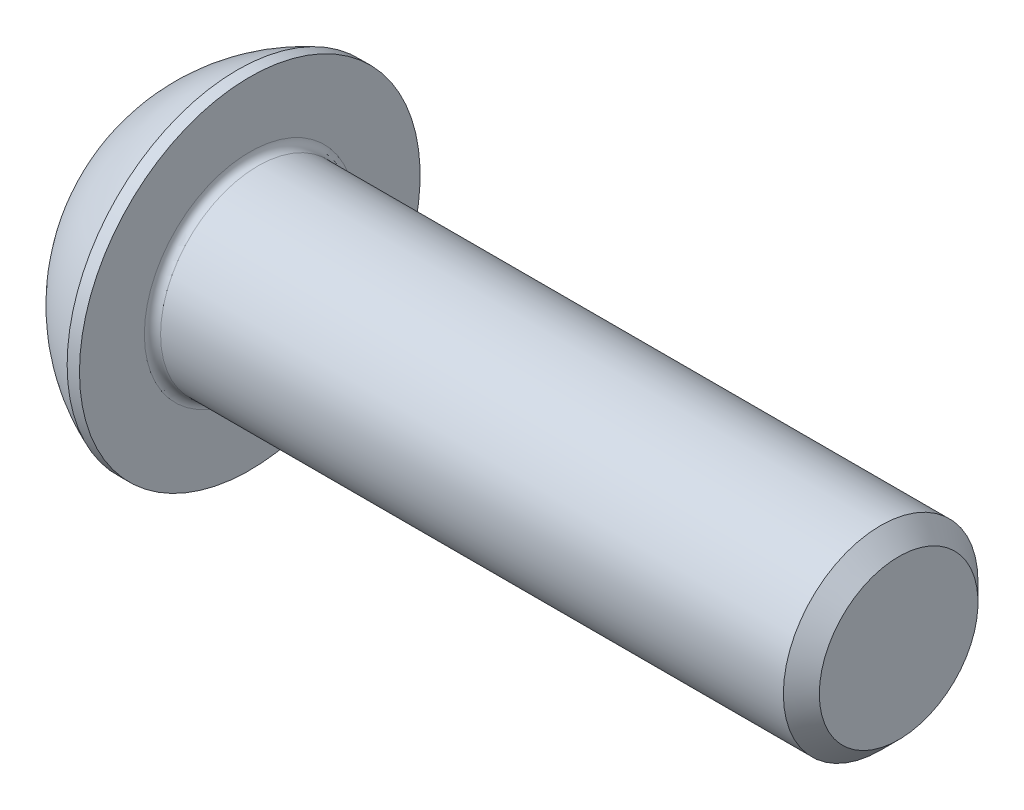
from build123d import *

# Parameters (mm, degrees)
FILLET1_R   = 0.25
HEX_2_DEPTH = 2.08


with BuildPart() as part:
    # BodySke → BaseBody (revolve)
    with BuildSketch(Plane.XY, mode=Mode.PRIVATE) as basebody_sk:
        with BuildLine():
            Line((23.3, 0), (23.3, 2.4455))
            Line((23.3, 2.4455), (22.7455, 3))
            Line((22.7455, 3), (3.3, 3))
            Line((3.3, 3), (3.3, 5.25))
            Line((3.3, 5.25), (2.92, 5.25))
            ThreePointArc((2.92, 5.25), (1.224500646, 4.199464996), (0, 2.625))
            Line((0, 2.625), (0, 0))
            Line((0, 0), (23.3, 0))
        make_face()
    revolve(basebody_sk.sketch.rotate(Axis((0, 0, 0), (1, 0, 0)), 90), axis=Axis((0, 0, 0), (1, 0, 0)))

    # Fillet1
    fillet1_edges = [part.edges().sort_by_distance(p)[0] for p in [
        (3.3, 0, -3),
    ]]
    fillet(fillet1_edges, radius=FILLET1_R)

    # Sketch2 → PreBroach (revolve, cut)
    with BuildSketch(Plane.XY, mode=Mode.PRIVATE) as prebroach_sk:
        Polygon((0, 2), (2.08, 2), (3.234700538, 0), (0, 0), align=None)
    revolve(prebroach_sk.sketch.rotate(Axis((0, 0, 0), (1, 0, 0)), 90), axis=Axis((0, 0, 0), (1, 0, 0)), mode=Mode.SUBTRACT)

    # Sketch3 → Hex 2 (cut)
    with BuildSketch(Plane(origin=(0, 0, 0), x_dir=(0, 0, -1), z_dir=(1, 0, 0))):
        Polygon((-2, -1.154700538), (-2, 1.154700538), (0, 2.309401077), (2, 1.154700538), (2, -1.154700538), (0, -2.309401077), align=None)
    extrude(amount=HEX_2_DEPTH, mode=Mode.SUBTRACT)


solid = part.part
